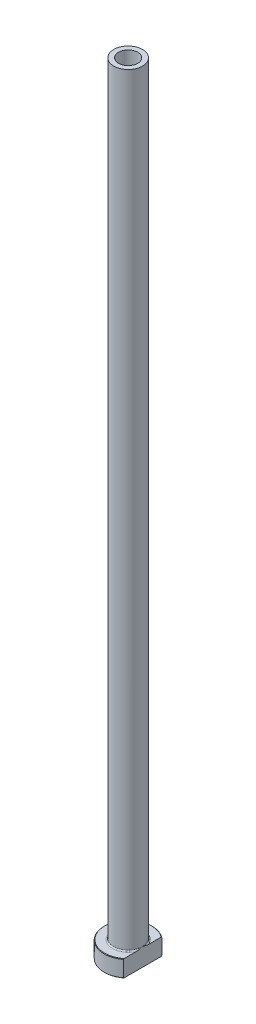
ISO-10303-21;
HEADER;
FILE_DESCRIPTION(('STEP AP214'),'2;1');
FILE_NAME('part.step','',(''),(''),'','','');
FILE_SCHEMA(('AUTOMOTIVE_DESIGN { 1 0 10303 214 1 1 1 1 }'));
ENDSEC;
DATA;
#1=APPLICATION_CONTEXT('core data for automotive mechanical design processes');
#2=APPLICATION_PROTOCOL_DEFINITION('international standard','automotive_design',2000,#1);
#3=PRODUCT_CONTEXT('',#1,'mechanical');
#4=PRODUCT('Part','Part','',(#3));
#5=PRODUCT_RELATED_PRODUCT_CATEGORY('part','',(#4));
#6=PRODUCT_DEFINITION_FORMATION('','',#4);
#7=PRODUCT_DEFINITION_CONTEXT('part definition',#1,'design');
#8=PRODUCT_DEFINITION('design','',#6,#7);
#9=PRODUCT_DEFINITION_SHAPE('','',#8);
#10=(LENGTH_UNIT() NAMED_UNIT(*) SI_UNIT(.MILLI.,.METRE.));
#11=(NAMED_UNIT(*) PLANE_ANGLE_UNIT() SI_UNIT($,.RADIAN.));
#12=(NAMED_UNIT(*) SI_UNIT($,.STERADIAN.) SOLID_ANGLE_UNIT());
#13=UNCERTAINTY_MEASURE_WITH_UNIT(LENGTH_MEASURE(1.E-05),#10,'distance_accuracy_value','');
#14=(GEOMETRIC_REPRESENTATION_CONTEXT(3) GLOBAL_UNCERTAINTY_ASSIGNED_CONTEXT((#13)) GLOBAL_UNIT_ASSIGNED_CONTEXT((#10,
#11,#12)) REPRESENTATION_CONTEXT('',''));
#15=CARTESIAN_POINT('',(0.,0.,0.));
#16=DIRECTION('',(0.,0.,1.));
#17=DIRECTION('',(1.,0.,0.));
#18=AXIS2_PLACEMENT_3D('',#15,#16,#17);
#19=CARTESIAN_POINT('',(0.,92.1876809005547,0.));
#20=DIRECTION('',(0.,1.,0.));
#21=DIRECTION('',(0.,0.,1.));
#22=AXIS2_PLACEMENT_3D('',#19,#20,#21);
#23=CYLINDRICAL_SURFACE('',#22,4.00000000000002);
#24=CARTESIAN_POINT('',(0.,325.,0.));
#25=DIRECTION('',(0.,1.,0.));
#26=DIRECTION('',(0.,0.,1.));
#27=AXIS2_PLACEMENT_3D('',#24,#25,#26);
#28=CIRCLE('',#27,4.00000000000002);
#29=CARTESIAN_POINT('',(0.,325.,4.00000000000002));
#30=VERTEX_POINT('',#29);
#31=EDGE_CURVE('E167',#30,#30,#28,.T.);
#32=ORIENTED_EDGE('',*,*,#31,.T.);
#33=EDGE_LOOP('',(#32));
#34=FACE_BOUND('',#33,.T.);
#35=CARTESIAN_POINT('',(0.,280.,0.));
#36=DIRECTION('',(0.,1.,0.));
#37=DIRECTION('',(0.,0.,1.));
#38=AXIS2_PLACEMENT_3D('',#35,#36,#37);
#39=CIRCLE('',#38,4.00000000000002);
#40=CARTESIAN_POINT('',(0.,280.,4.00000000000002));
#41=VERTEX_POINT('',#40);
#42=EDGE_CURVE('E170',#41,#41,#39,.T.);
#43=ORIENTED_EDGE('',*,*,#42,.F.);
#44=EDGE_LOOP('',(#43));
#45=FACE_BOUND('',#44,.T.);
#46=ADVANCED_FACE('F32',(#34,#45),#23,.F.);
#47=CARTESIAN_POINT('',(-4.00000000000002,325.,0.));
#48=DIRECTION('',(0.,1.,0.));
#49=DIRECTION('',(0.,0.,1.));
#50=AXIS2_PLACEMENT_3D('',#47,#48,#49);
#51=PLANE('',#50);
#52=CARTESIAN_POINT('',(0.,325.,0.));
#53=DIRECTION('',(0.,1.,0.));
#54=DIRECTION('',(0.,0.,1.));
#55=AXIS2_PLACEMENT_3D('',#52,#53,#54);
#56=CIRCLE('',#55,6.00000000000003);
#57=CARTESIAN_POINT('',(0.,325.,6.00000000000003));
#58=VERTEX_POINT('',#57);
#59=EDGE_CURVE('E174',#58,#58,#56,.T.);
#60=ORIENTED_EDGE('',*,*,#59,.T.);
#61=EDGE_LOOP('',(#60));
#62=FACE_BOUND('',#61,.T.);
#63=ORIENTED_EDGE('',*,*,#31,.F.);
#64=EDGE_LOOP('',(#63));
#65=FACE_BOUND('',#64,.T.);
#66=ADVANCED_FACE('F157',(#62,#65),#51,.T.);
#67=CARTESIAN_POINT('',(0.,92.1876809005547,0.));
#68=DIRECTION('',(0.,1.,0.));
#69=DIRECTION('',(0.,0.,1.));
#70=AXIS2_PLACEMENT_3D('',#67,#68,#69);
#71=CYLINDRICAL_SURFACE('',#70,6.00000000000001);
#72=CARTESIAN_POINT('',(0.,7.50000000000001,0.));
#73=DIRECTION('',(0.,1.,0.));
#74=DIRECTION('',(0.,0.,1.));
#75=AXIS2_PLACEMENT_3D('',#72,#73,#74);
#76=CIRCLE('',#75,6.00000000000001);
#77=CARTESIAN_POINT('',(6.,7.50000000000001,0.));
#78=VERTEX_POINT('',#77);
#79=EDGE_CURVE('E180',#78,#78,#76,.T.);
#80=ORIENTED_EDGE('',*,*,#79,.T.);
#81=EDGE_LOOP('',(#80));
#82=FACE_BOUND('',#81,.T.);
#83=ORIENTED_EDGE('',*,*,#59,.F.);
#84=EDGE_LOOP('',(#83));
#85=FACE_BOUND('',#84,.T.);
#86=ADVANCED_FACE('F162',(#82,#85),#71,.T.);
#87=CARTESIAN_POINT('',(-5.99999999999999,7.,0.));
#88=DIRECTION('',(0.,1.,0.));
#89=DIRECTION('',(0.,0.,1.));
#90=AXIS2_PLACEMENT_3D('',#87,#88,#89);
#91=PLANE('',#90);
#92=DIRECTION('',(0.,0.,1.));
#93=VECTOR('',#92,1.);
#94=CARTESIAN_POINT('',(6.,7.,0.));
#95=LINE('',#94,#93);
#96=CARTESIAN_POINT('',(6.,7.,-7.74854825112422));
#97=VERTEX_POINT('',#96);
#98=CARTESIAN_POINT('',(6.,7.,-2.50000000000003));
#99=VERTEX_POINT('',#98);
#100=EDGE_CURVE('E54',#97,#99,#95,.T.);
#101=ORIENTED_EDGE('',*,*,#100,.F.);
#102=CARTESIAN_POINT('',(0.,7.,0.));
#103=DIRECTION('',(0.,1.,0.));
#104=DIRECTION('',(0.,0.,1.));
#105=AXIS2_PLACEMENT_3D('',#102,#103,#104);
#106=CIRCLE('',#105,9.80000000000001);
#107=CARTESIAN_POINT('',(5.99999999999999,7.,7.74854825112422));
#108=VERTEX_POINT('',#107);
#109=EDGE_CURVE('E186',#97,#108,#106,.T.);
#110=ORIENTED_EDGE('',*,*,#109,.T.);
#111=CARTESIAN_POINT('',(6.,7.,2.50000000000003));
#112=VERTEX_POINT('',#111);
#113=EDGE_CURVE('E134',#112,#108,#95,.T.);
#114=ORIENTED_EDGE('',*,*,#113,.F.);
#115=CARTESIAN_POINT('',(0.,7.,0.));
#116=DIRECTION('',(0.,1.,0.));
#117=DIRECTION('',(0.,0.,1.));
#118=AXIS2_PLACEMENT_3D('',#115,#116,#117);
#119=CIRCLE('',#118,6.50000000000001);
#120=EDGE_CURVE('E183',#112,#99,#119,.F.);
#121=ORIENTED_EDGE('',*,*,#120,.T.);
#122=EDGE_LOOP('',(#101,#110,#114,#121));
#123=FACE_BOUND('',#122,.T.);
#124=ADVANCED_FACE('F197',(#123),#91,.T.);
#125=CARTESIAN_POINT('',(0.,92.1876809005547,0.));
#126=DIRECTION('',(0.,1.,0.));
#127=DIRECTION('',(0.,0.,1.));
#128=AXIS2_PLACEMENT_3D('',#125,#126,#127);
#129=CYLINDRICAL_SURFACE('',#128,9.99999999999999);
#130=DIRECTION('',(0.,-1.,0.));
#131=VECTOR('',#130,1.);
#132=CARTESIAN_POINT('',(5.99999999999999,325.,7.99999999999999));
#133=LINE('',#132,#131);
#134=CARTESIAN_POINT('',(5.99999999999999,6.80000000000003,7.99999999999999));
#135=VERTEX_POINT('',#134);
#136=CARTESIAN_POINT('',(5.99999999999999,0.200000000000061,7.99999999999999));
#137=VERTEX_POINT('',#136);
#138=EDGE_CURVE('E82',#135,#137,#133,.T.);
#139=ORIENTED_EDGE('',*,*,#138,.F.);
#140=CARTESIAN_POINT('',(0.,6.80000000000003,0.));
#141=DIRECTION('',(0.,1.,0.));
#142=DIRECTION('',(0.,0.,1.));
#143=AXIS2_PLACEMENT_3D('',#140,#141,#142);
#144=CIRCLE('',#143,9.99999999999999);
#145=CARTESIAN_POINT('',(6.,6.80000000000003,-7.99999999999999));
#146=VERTEX_POINT('',#145);
#147=EDGE_CURVE('E95',#135,#146,#144,.F.);
#148=ORIENTED_EDGE('',*,*,#147,.T.);
#149=DIRECTION('',(0.,-1.,0.));
#150=VECTOR('',#149,1.);
#151=CARTESIAN_POINT('',(6.,325.,-7.99999999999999));
#152=LINE('',#151,#150);
#153=CARTESIAN_POINT('',(6.,0.200000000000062,-7.99999999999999));
#154=VERTEX_POINT('',#153);
#155=EDGE_CURVE('E192',#146,#154,#152,.T.);
#156=ORIENTED_EDGE('',*,*,#155,.T.);
#157=CARTESIAN_POINT('',(0.,0.200000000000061,0.));
#158=DIRECTION('',(0.,-1.,0.));
#159=DIRECTION('',(0.,0.,-1.));
#160=AXIS2_PLACEMENT_3D('',#157,#158,#159);
#161=CIRCLE('',#160,9.99999999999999);
#162=EDGE_CURVE('E98',#154,#137,#161,.F.);
#163=ORIENTED_EDGE('',*,*,#162,.T.);
#164=EDGE_LOOP('',(#139,#148,#156,#163));
#165=FACE_BOUND('',#164,.T.);
#166=ADVANCED_FACE('F190',(#165),#129,.T.);
#167=CARTESIAN_POINT('',(-9.99999999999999,0.,0.));
#168=DIRECTION('',(0.,-1.,0.));
#169=DIRECTION('',(0.,0.,-1.));
#170=AXIS2_PLACEMENT_3D('',#167,#168,#169);
#171=PLANE('',#170);
#172=CARTESIAN_POINT('',(0.,0.,0.));
#173=DIRECTION('',(0.,-1.,0.));
#174=DIRECTION('',(0.,0.,-1.));
#175=AXIS2_PLACEMENT_3D('',#172,#173,#174);
#176=CIRCLE('',#175,4.75);
#177=CARTESIAN_POINT('',(0.,0.,-4.75));
#178=VERTEX_POINT('',#177);
#179=EDGE_CURVE('E40',#178,#178,#176,.F.);
#180=ORIENTED_EDGE('',*,*,#179,.T.);
#181=EDGE_LOOP('',(#180));
#182=FACE_BOUND('',#181,.T.);
#183=DIRECTION('',(0.,0.,-1.));
#184=VECTOR('',#183,1.);
#185=CARTESIAN_POINT('',(5.99999999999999,0.,7.99999999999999));
#186=LINE('',#185,#184);
#187=CARTESIAN_POINT('',(5.99999999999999,0.,7.74854825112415));
#188=VERTEX_POINT('',#187);
#189=CARTESIAN_POINT('',(6.,0.,-7.74854825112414));
#190=VERTEX_POINT('',#189);
#191=EDGE_CURVE('E47',#188,#190,#186,.T.);
#192=ORIENTED_EDGE('',*,*,#191,.F.);
#193=CARTESIAN_POINT('',(0.,0.,0.));
#194=DIRECTION('',(0.,-1.,0.));
#195=DIRECTION('',(0.,0.,-1.));
#196=AXIS2_PLACEMENT_3D('',#193,#194,#195);
#197=CIRCLE('',#196,9.79999999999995);
#198=EDGE_CURVE('E92',#188,#190,#197,.T.);
#199=ORIENTED_EDGE('',*,*,#198,.T.);
#200=EDGE_LOOP('',(#192,#199));
#201=FACE_BOUND('',#200,.T.);
#202=ADVANCED_FACE('F91',(#182,#201),#171,.T.);
#203=CARTESIAN_POINT('',(0.,92.1876809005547,0.));
#204=DIRECTION('',(0.,1.,0.));
#205=DIRECTION('',(0.,0.,1.));
#206=AXIS2_PLACEMENT_3D('',#203,#204,#205);
#207=CYLINDRICAL_SURFACE('',#206,4.25000000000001);
#208=CARTESIAN_POINT('',(0.,0.499999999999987,0.));
#209=DIRECTION('',(0.,-1.,0.));
#210=DIRECTION('',(0.,0.,-1.));
#211=AXIS2_PLACEMENT_3D('',#208,#209,#210);
#212=CIRCLE('',#211,4.25000000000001);
#213=CARTESIAN_POINT('',(0.,0.499999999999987,-4.25000000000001));
#214=VERTEX_POINT('',#213);
#215=EDGE_CURVE('E11',#214,#214,#212,.T.);
#216=ORIENTED_EDGE('',*,*,#215,.T.);
#217=EDGE_LOOP('',(#216));
#218=FACE_BOUND('',#217,.T.);
#219=CARTESIAN_POINT('',(0.,268.,0.));
#220=DIRECTION('',(0.,1.,0.));
#221=DIRECTION('',(0.,0.,1.));
#222=AXIS2_PLACEMENT_3D('',#219,#220,#221);
#223=CIRCLE('',#222,4.25000000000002);
#224=CARTESIAN_POINT('',(0.,268.,4.25000000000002));
#225=VERTEX_POINT('',#224);
#226=EDGE_CURVE('E172',#225,#225,#223,.T.);
#227=ORIENTED_EDGE('',*,*,#226,.T.);
#228=EDGE_LOOP('',(#227));
#229=FACE_BOUND('',#228,.T.);
#230=ADVANCED_FACE('F215',(#218,#229),#207,.F.);
#231=CARTESIAN_POINT('',(0.,268.,0.));
#232=DIRECTION('',(0.,-1.,0.));
#233=DIRECTION('',(0.,0.,-1.));
#234=AXIS2_PLACEMENT_3D('',#231,#232,#233);
#235=CONICAL_SURFACE('',#234,4.25000000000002,0.0208303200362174);
#236=ORIENTED_EDGE('',*,*,#42,.T.);
#237=EDGE_LOOP('',(#236));
#238=FACE_BOUND('',#237,.T.);
#239=ORIENTED_EDGE('',*,*,#226,.F.);
#240=EDGE_LOOP('',(#239));
#241=FACE_BOUND('',#240,.T.);
#242=ADVANCED_FACE('F111',(#238,#241),#235,.F.);
#243=CARTESIAN_POINT('',(0.,7.50000000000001,0.));
#244=DIRECTION('',(0.,1.,0.));
#245=DIRECTION('',(0.,0.,1.));
#246=AXIS2_PLACEMENT_3D('',#243,#244,#245);
#247=TOROIDAL_SURFACE('',#246,6.50000000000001,0.5);
#248=ORIENTED_EDGE('',*,*,#120,.F.);
#249=CARTESIAN_POINT('',(6.,7.50000000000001,0.));
#250=CARTESIAN_POINT('',(6.,7.50000080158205,6.70578721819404E-11));
#251=CARTESIAN_POINT('',(6.,7.50000160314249,2.62462886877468E-07));
#252=CARTESIAN_POINT('',(6.,7.50000311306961,1.01907237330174E-06));
#253=CARTESIAN_POINT('',(6.,7.500003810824,1.52837988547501E-06));
#254=CARTESIAN_POINT('',(6.,7.50000523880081,2.74467699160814E-06));
#255=CARTESIAN_POINT('',(6.,7.50000595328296,3.47066827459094E-06));
#256=CARTESIAN_POINT('',(6.,7.50000725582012,4.99336301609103E-06));
#257=CARTESIAN_POINT('',(6.,7.50000784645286,5.78800239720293E-06));
#258=CARTESIAN_POINT('',(6.,7.50000997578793,8.796617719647E-06));
#259=CARTESIAN_POINT('',(6.,7.50001139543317,1.10980696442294E-05));
#260=CARTESIAN_POINT('',(6.,7.50001378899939,1.57116121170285E-05));
#261=CARTESIAN_POINT('',(6.,7.5000147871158,1.80117467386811E-05));
#262=CARTESIAN_POINT('',(6.,7.50001885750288,2.75423879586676E-05));
#263=CARTESIAN_POINT('',(6.,7.50002181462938,3.48285137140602E-05));
#264=CARTESIAN_POINT('',(6.,7.50002628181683,4.87408463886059E-05));
#265=CARTESIAN_POINT('',(6.,7.50002793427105,5.5321444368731E-05));
#266=CARTESIAN_POINT('',(6.,7.50003978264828,0.000103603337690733));
#267=CARTESIAN_POINT('',(6.,7.50004857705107,0.000145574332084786));
#268=CARTESIAN_POINT('',(6.,7.50008704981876,0.000310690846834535));
#269=CARTESIAN_POINT('',(6.,7.5001239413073,0.000432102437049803));
#270=CARTESIAN_POINT('',(6.,7.50026686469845,0.000911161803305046));
#271=CARTESIAN_POINT('',(6.,7.50036807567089,0.00126981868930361));
#272=CARTESIAN_POINT('',(6.,7.50077195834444,0.00268961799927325));
#273=CARTESIAN_POINT('',(6.,7.50108058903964,0.00374948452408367));
#274=CARTESIAN_POINT('',(6.,7.50236320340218,0.0081665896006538));
#275=CARTESIAN_POINT('',(6.,7.50332976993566,0.0115254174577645));
#276=CARTESIAN_POINT('',(5.99999999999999,7.51709820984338,0.0593544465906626));
#277=CARTESIAN_POINT('',(6.,7.52995465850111,0.103813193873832));
#278=CARTESIAN_POINT('',(6.,7.55506029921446,0.19097766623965));
#279=CARTESIAN_POINT('',(6.,7.56731321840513,0.233682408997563));
#280=CARTESIAN_POINT('',(6.,7.59325665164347,0.324512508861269));
#281=CARTESIAN_POINT('',(6.,7.60693346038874,0.372641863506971));
#282=CARTESIAN_POINT('',(6.,7.63422038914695,0.469489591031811));
#283=CARTESIAN_POINT('',(6.,7.64782813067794,0.518208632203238));
#284=CARTESIAN_POINT('',(6.,7.68043734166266,0.636338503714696));
#285=CARTESIAN_POINT('',(6.,7.69928754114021,0.705791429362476));
#286=CARTESIAN_POINT('',(6.,7.73566887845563,0.843102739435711));
#287=CARTESIAN_POINT('',(6.,7.75322160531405,0.910955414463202));
#288=CARTESIAN_POINT('',(6.,7.80024878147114,1.09857433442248));
#289=CARTESIAN_POINT('',(6.,7.82864900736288,1.21861610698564));
#290=CARTESIAN_POINT('',(6.,7.88105633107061,1.46081534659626));
#291=CARTESIAN_POINT('',(6.,7.90502088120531,1.58298212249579));
#292=CARTESIAN_POINT('',(6.,7.94810499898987,1.83866408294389));
#293=CARTESIAN_POINT('',(6.,7.96665856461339,1.97228081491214));
#294=CARTESIAN_POINT('',(6.,7.98621697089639,2.17329578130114));
#295=CARTESIAN_POINT('',(6.,7.99135613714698,2.24029152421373));
#296=CARTESIAN_POINT('',(6.,7.99832928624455,2.37444824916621));
#297=CARTESIAN_POINT('',(6.,8.00016429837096,2.44160917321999));
#298=CARTESIAN_POINT('',(6.,7.99984674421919,2.56298631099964));
#299=CARTESIAN_POINT('',(6.,7.99839439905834,2.61720324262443));
#300=CARTESIAN_POINT('',(6.,7.9923655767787,2.72552036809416));
#301=CARTESIAN_POINT('',(6.,7.98778645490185,2.77962042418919));
#302=CARTESIAN_POINT('',(6.,7.97492915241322,2.88664710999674));
#303=CARTESIAN_POINT('',(6.,7.96670262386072,2.93957965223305));
#304=CARTESIAN_POINT('',(6.,7.94570253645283,3.04448333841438));
#305=CARTESIAN_POINT('',(6.,7.93293488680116,3.09645563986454));
#306=CARTESIAN_POINT('',(6.,7.90135968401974,3.19943606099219));
#307=CARTESIAN_POINT('',(6.,7.8824717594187,3.25042120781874));
#308=CARTESIAN_POINT('',(6.,7.8481868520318,3.3240378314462));
#309=CARTESIAN_POINT('',(6.,7.83579052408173,3.34806431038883));
#310=CARTESIAN_POINT('',(6.,7.80866016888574,3.39474488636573));
#311=CARTESIAN_POINT('',(6.,7.79392968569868,3.41740099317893));
#312=CARTESIAN_POINT('',(6.,7.76577135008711,3.45524173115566));
#313=CARTESIAN_POINT('',(6.,7.75294719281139,3.47087266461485));
#314=CARTESIAN_POINT('',(6.,7.72556313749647,3.50058040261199));
#315=CARTESIAN_POINT('',(6.,7.7110020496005,3.51465612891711));
#316=CARTESIAN_POINT('',(6.,7.67984897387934,3.54077006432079));
#317=CARTESIAN_POINT('',(6.,7.66323651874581,3.55278430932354));
#318=CARTESIAN_POINT('',(6.,7.62815222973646,3.57370259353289));
#319=CARTESIAN_POINT('',(6.,7.60968501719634,3.58261412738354));
#320=CARTESIAN_POINT('',(6.,7.57639898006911,3.59454653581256));
#321=CARTESIAN_POINT('',(6.,7.56191673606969,3.5985038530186));
#322=CARTESIAN_POINT('',(6.,7.53249228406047,3.60392336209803));
#323=CARTESIAN_POINT('',(6.,7.51755044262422,3.60538749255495));
#324=CARTESIAN_POINT('',(6.,7.48761833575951,3.60568912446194));
#325=CARTESIAN_POINT('',(6.,7.47262803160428,3.60452285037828));
#326=CARTESIAN_POINT('',(6.,7.44306278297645,3.59966500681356));
#327=CARTESIAN_POINT('',(6.,7.42848812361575,3.59597174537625));
#328=CARTESIAN_POINT('',(6.,7.3970215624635,3.58531109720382));
#329=CARTESIAN_POINT('',(6.,7.38031267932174,3.57780732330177));
#330=CARTESIAN_POINT('',(6.,7.34834450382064,3.56018434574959));
#331=CARTESIAN_POINT('',(6.,7.33308764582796,3.55006085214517));
#332=CARTESIAN_POINT('',(6.,7.29715308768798,3.52252389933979));
#333=CARTESIAN_POINT('',(6.,7.27737832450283,3.50394102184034));
#334=CARTESIAN_POINT('',(6.,7.2408841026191,3.46399503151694));
#335=CARTESIAN_POINT('',(6.,7.22417302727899,3.44262455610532));
#336=CARTESIAN_POINT('',(6.,7.18148338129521,3.38088102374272));
#337=CARTESIAN_POINT('',(6.,7.15831783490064,3.33858120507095));
#338=CARTESIAN_POINT('',(6.,7.11822747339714,3.25128083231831));
#339=CARTESIAN_POINT('',(6.,7.10130560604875,3.20627901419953));
#340=CARTESIAN_POINT('',(6.,7.07193388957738,3.11375892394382));
#341=CARTESIAN_POINT('',(6.,7.0595925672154,3.06620687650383));
#342=CARTESIAN_POINT('',(6.,7.03888782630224,2.97022063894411));
#343=CARTESIAN_POINT('',(6.,7.03052890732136,2.92178551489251));
#344=CARTESIAN_POINT('',(6.,7.0169756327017,2.82374574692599));
#345=CARTESIAN_POINT('',(6.,7.01183067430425,2.7741344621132));
#346=CARTESIAN_POINT('',(6.,7.00435015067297,2.6747526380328));
#347=CARTESIAN_POINT('',(6.,7.00201229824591,2.62498226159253));
#348=CARTESIAN_POINT('',(6.,6.9989719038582,2.49377014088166));
#349=CARTESIAN_POINT('',(6.,7.00025005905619,2.41228296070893));
#350=CARTESIAN_POINT('',(6.,7.00775652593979,2.24952135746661));
#351=CARTESIAN_POINT('',(6.,7.01398784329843,2.16824709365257));
#352=CARTESIAN_POINT('',(6.,7.03045087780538,2.0057553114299));
#353=CARTESIAN_POINT('',(6.,7.04070001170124,1.92453960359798));
#354=CARTESIAN_POINT('',(6.,7.06442774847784,1.76257601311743));
#355=CARTESIAN_POINT('',(6.,7.07790697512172,1.68182822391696));
#356=CARTESIAN_POINT('',(6.,7.11973611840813,1.45394312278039));
#357=CARTESIAN_POINT('',(6.,7.1511384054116,1.30736987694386));
#358=CARTESIAN_POINT('',(6.,7.21927147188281,1.01717316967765));
#359=CARTESIAN_POINT('',(6.,7.25594155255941,0.873534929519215));
#360=CARTESIAN_POINT('',(6.,7.30765759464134,0.680321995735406));
#361=CARTESIAN_POINT('',(6.,7.32124979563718,0.630351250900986));
#362=CARTESIAN_POINT('',(6.,7.34913735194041,0.529103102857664));
#363=CARTESIAN_POINT('',(6.,7.36344174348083,0.477828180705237));
#364=CARTESIAN_POINT('',(6.,7.3880931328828,0.390268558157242));
#365=CARTESIAN_POINT('',(6.,7.39837954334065,0.353966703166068));
#366=CARTESIAN_POINT('',(6.,7.41893445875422,0.28177830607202));
#367=CARTESIAN_POINT('',(6.,7.42920197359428,0.245891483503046));
#368=CARTESIAN_POINT('',(6.,7.44864004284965,0.178137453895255));
#369=CARTESIAN_POINT('',(6.,7.45780513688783,0.146268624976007));
#370=CARTESIAN_POINT('',(6.,7.47656016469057,0.0812304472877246));
#371=CARTESIAN_POINT('',(5.99999999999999,7.48615204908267,0.0480615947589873));
#372=CARTESIAN_POINT('',(6.,7.4966696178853,0.0115277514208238));
#373=CARTESIAN_POINT('',(6.,7.49763547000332,0.00817123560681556));
#374=CARTESIAN_POINT('',(6.,7.49891791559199,0.00375466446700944));
#375=CARTESIAN_POINT('',(6.,7.49922706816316,0.00269301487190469));
#376=CARTESIAN_POINT('',(6.,7.49963158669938,0.00127098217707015));
#377=CARTESIAN_POINT('',(6.,7.49973292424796,0.000911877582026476));
#378=CARTESIAN_POINT('',(6.,7.49987600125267,0.000432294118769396));
#379=CARTESIAN_POINT('',(6.,7.49991291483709,0.000310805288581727));
#380=CARTESIAN_POINT('',(6.,7.49995140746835,0.000145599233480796));
#381=CARTESIAN_POINT('',(6.,7.49996020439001,0.000103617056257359));
#382=CARTESIAN_POINT('',(6.,7.49997205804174,5.53238264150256E-05));
#383=CARTESIAN_POINT('',(6.,7.49997371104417,4.87425744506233E-05));
#384=CARTESIAN_POINT('',(6.,7.49997817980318,3.48289298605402E-05));
#385=CARTESIAN_POINT('',(6.,7.49998113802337,2.75421804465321E-05));
#386=CARTESIAN_POINT('',(6.,7.49998520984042,1.80109026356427E-05));
#387=CARTESIAN_POINT('',(6.,7.49998620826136,1.57107189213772E-05));
#388=CARTESIAN_POINT('',(6.,7.49998860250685,1.10971311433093E-05));
#389=CARTESIAN_POINT('',(6.,7.49999002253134,8.79568853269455E-06));
#390=CARTESIAN_POINT('',(6.,7.49999215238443,5.78714815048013E-06));
#391=CARTESIAN_POINT('',(6.,7.49999274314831,4.99254470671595E-06));
#392=CARTESIAN_POINT('',(6.,7.49999404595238,3.46994550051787E-06));
#393=CARTESIAN_POINT('',(6.,7.49999476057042,2.74401447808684E-06));
#394=CARTESIAN_POINT('',(6.,7.4999961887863,1.5278603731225E-06));
#395=CARTESIAN_POINT('',(6.,7.4999968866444,1.01863078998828E-06));
#396=CARTESIAN_POINT('',(6.,7.49999839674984,2.62215751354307E-07));
#397=CARTESIAN_POINT('',(6.,7.49999919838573,-6.70592677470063E-11));
#398=CARTESIAN_POINT('',(6.,7.50000000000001,0.));
#399=B_SPLINE_CURVE_WITH_KNOTS('',3,(#249,#250,#251,#252,#253,#254,#255,#256,#257,#258,#259,
#260,#261,#262,#263,#264,#265,#266,#267,#268,#269,#270,#271,#272,#273,#274,#275,#276,#277,#278,
#279,#280,#281,#282,#283,#284,#285,#286,#287,#288,#289,#290,#291,#292,#293,#294,#295,#296,#297,
#298,#299,#300,#301,#302,#303,#304,#305,#306,#307,#308,#309,#310,#311,#312,#313,#314,#315,#316,
#317,#318,#319,#320,#321,#322,#323,#324,#325,#326,#327,#328,#329,#330,#331,#332,#333,#334,#335,
#336,#337,#338,#339,#340,#341,#342,#343,#344,#345,#346,#347,#348,#349,#350,#351,#352,#353,#354,
#355,#356,#357,#358,#359,#360,#361,#362,#363,#364,#365,#366,#367,#368,#369,#370,#371,#372,#373,
#374,#375,#376,#377,#378,#379,#380,#381,#382,#383,#384,#385,#386,#387,#388,#389,#390,#391,#392,
#393,#394,#395,#396,#397,#398),.UNSPECIFIED.,.T.,.F.,(4,2,2,2,2,2,2,2,2,2,2,2,2,2,2,2,2,2,2,2,2,
2,2,2,2,2,2,2,2,2,2,2,2,2,2,2,2,2,2,2,2,2,2,2,2,2,2,2,2,2,2,2,2,2,2,2,2,2,2,2,2,2,2,2,2,2,2,2,2,
2,2,2,2,2,4),(0.,2.41532701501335E-06,5.00161511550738E-06,8.04115600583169E-06,
1.10092267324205E-05,1.90889688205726E-05,2.66047306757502E-05,5.01454015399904E-05,
7.04739942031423E-05,0.000199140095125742,0.000579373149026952,0.0016978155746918,
0.00500893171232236,0.0154949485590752,0.154330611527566,0.287615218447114,0.43771908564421,
0.589470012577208,0.805361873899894,1.0156173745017,1.38561400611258,1.75899405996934,
2.16331287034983,2.36482907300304,2.56628249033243,2.72891861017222,2.89169246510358,
3.05223140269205,3.21256219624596,3.37509011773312,3.4560997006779,3.53698744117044,
3.59753760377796,3.65812948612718,3.71938396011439,3.78048942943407,3.82533702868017,
3.87014974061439,3.91502681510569,3.95993396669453,4.01458097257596,4.06931803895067,
4.1502680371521,4.23143634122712,4.37530581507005,4.51924312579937,4.66640085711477,
4.81372446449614,4.96325999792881,5.11267360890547,5.35695170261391,5.60137814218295,
5.84687607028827,6.09242144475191,6.54191534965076,6.98659302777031,7.14195169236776,
7.30164895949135,7.41484221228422,7.52682205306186,7.62630458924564,7.72988447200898,
7.74036324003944,7.74367992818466,7.74479976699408,7.74518024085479,7.74530894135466,
7.74532927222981,7.74535281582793,7.74536033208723,7.74536841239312,7.74537138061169,
7.74537442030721,7.74537700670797,7.74537942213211),.UNSPECIFIED.);
#400=EDGE_CURVE('E126',#112,#78,#399,.T.);
#401=ORIENTED_EDGE('',*,*,#400,.T.);
#402=ORIENTED_EDGE('',*,*,#79,.F.);
#403=CARTESIAN_POINT('',(6.,7.50000000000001,0.));
#404=CARTESIAN_POINT('',(6.,7.49999919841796,-6.70567544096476E-11));
#405=CARTESIAN_POINT('',(6.,7.49999839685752,-2.62462885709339E-07));
#406=CARTESIAN_POINT('',(6.,7.49999688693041,-1.01907237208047E-06));
#407=CARTESIAN_POINT('',(6.,7.49999618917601,-1.52837988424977E-06));
#408=CARTESIAN_POINT('',(6.,7.4999947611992,-2.74467699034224E-06));
#409=CARTESIAN_POINT('',(6.,7.49999404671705,-3.47066827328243E-06));
#410=CARTESIAN_POINT('',(6.,7.49999274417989,-4.99336301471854E-06));
#411=CARTESIAN_POINT('',(6.,7.49999215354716,-5.78800239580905E-06));
#412=CARTESIAN_POINT('',(6.,7.49999002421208,-8.79661771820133E-06));
#413=CARTESIAN_POINT('',(6.,7.49998860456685,-1.10980696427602E-05));
#414=CARTESIAN_POINT('',(6.,7.49998621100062,-1.5711612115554E-05));
#415=CARTESIAN_POINT('',(6.,7.49998521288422,-1.80117467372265E-05));
#416=CARTESIAN_POINT('',(6.,7.49998114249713,-2.75423879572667E-05));
#417=CARTESIAN_POINT('',(6.,7.49997818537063,-3.48285137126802E-05));
#418=CARTESIAN_POINT('',(6.,7.49997371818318,-4.8740846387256E-05));
#419=CARTESIAN_POINT('',(6.,7.49997206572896,-5.53214443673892E-05));
#420=CARTESIAN_POINT('',(6.,7.49996021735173,-0.000103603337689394));
#421=CARTESIAN_POINT('',(6.,7.49995142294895,-0.000145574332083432));
#422=CARTESIAN_POINT('',(6.,7.49991295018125,-0.000310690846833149));
#423=CARTESIAN_POINT('',(6.,7.49987605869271,-0.000432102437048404));
#424=CARTESIAN_POINT('',(6.,7.49973313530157,-0.000911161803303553));
#425=CARTESIAN_POINT('',(6.,7.49963192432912,-0.00126981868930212));
#426=CARTESIAN_POINT('',(6.,7.49922804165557,-0.00268961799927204));
#427=CARTESIAN_POINT('',(6.,7.49891941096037,-0.00374948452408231));
#428=CARTESIAN_POINT('',(6.,7.49763679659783,-0.00816658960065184));
#429=CARTESIAN_POINT('',(6.,7.49667023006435,-0.0115254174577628));
#430=CARTESIAN_POINT('',(5.99999999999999,7.48290179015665,-0.0593544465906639));
#431=CARTESIAN_POINT('',(6.,7.47004534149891,-0.10381319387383));
#432=CARTESIAN_POINT('',(6.,7.44493970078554,-0.190977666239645));
#433=CARTESIAN_POINT('',(6.,7.43268678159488,-0.233682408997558));
#434=CARTESIAN_POINT('',(6.,7.40674334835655,-0.324512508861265));
#435=CARTESIAN_POINT('',(6.,7.39306653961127,-0.372641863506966));
#436=CARTESIAN_POINT('',(6.,7.36577961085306,-0.469489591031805));
#437=CARTESIAN_POINT('',(6.,7.35217186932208,-0.518208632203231));
#438=CARTESIAN_POINT('',(6.,7.31956265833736,-0.636338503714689));
#439=CARTESIAN_POINT('',(6.,7.30071245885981,-0.70579142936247));
#440=CARTESIAN_POINT('',(6.,7.26433112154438,-0.843102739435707));
#441=CARTESIAN_POINT('',(6.,7.24677839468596,-0.910955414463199));
#442=CARTESIAN_POINT('',(6.,7.19975121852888,-1.09857433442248));
#443=CARTESIAN_POINT('',(6.,7.17135099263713,-1.21861610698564));
#444=CARTESIAN_POINT('',(6.,7.1189436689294,-1.46081534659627));
#445=CARTESIAN_POINT('',(6.,7.0949791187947,-1.58298212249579));
#446=CARTESIAN_POINT('',(6.,7.05189500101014,-1.8386640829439));
#447=CARTESIAN_POINT('',(6.,7.03334143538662,-1.97228081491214));
#448=CARTESIAN_POINT('',(6.,7.01378302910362,-2.17329578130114));
#449=CARTESIAN_POINT('',(6.,7.00864386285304,-2.24029152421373));
#450=CARTESIAN_POINT('',(6.,7.00167071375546,-2.37444824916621));
#451=CARTESIAN_POINT('',(6.,6.99983570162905,-2.44160917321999));
#452=CARTESIAN_POINT('',(6.,7.00015325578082,-2.56298631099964));
#453=CARTESIAN_POINT('',(6.,7.00160560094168,-2.61720324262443));
#454=CARTESIAN_POINT('',(6.,7.00763442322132,-2.72552036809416));
#455=CARTESIAN_POINT('',(6.,7.01221354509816,-2.77962042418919));
#456=CARTESIAN_POINT('',(6.,7.02507084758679,-2.88664710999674));
#457=CARTESIAN_POINT('',(6.,7.03329737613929,-2.93957965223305));
#458=CARTESIAN_POINT('',(6.,7.05429746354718,-3.04448333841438));
#459=CARTESIAN_POINT('',(6.,7.06706511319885,-3.09645563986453));
#460=CARTESIAN_POINT('',(6.,7.09864031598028,-3.19943606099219));
#461=CARTESIAN_POINT('',(6.,7.11752824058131,-3.25042120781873));
#462=CARTESIAN_POINT('',(6.,7.15181314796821,-3.32403783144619));
#463=CARTESIAN_POINT('',(6.,7.16420947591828,-3.34806431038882));
#464=CARTESIAN_POINT('',(6.,7.19133983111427,-3.39474488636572));
#465=CARTESIAN_POINT('',(6.,7.20607031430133,-3.41740099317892));
#466=CARTESIAN_POINT('',(6.,7.23422864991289,-3.45524173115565));
#467=CARTESIAN_POINT('',(6.,7.24705280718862,-3.47087266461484));
#468=CARTESIAN_POINT('',(6.,7.27443686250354,-3.50058040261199));
#469=CARTESIAN_POINT('',(6.,7.28899795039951,-3.5146561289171));
#470=CARTESIAN_POINT('',(6.,7.32015102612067,-3.54077006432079));
#471=CARTESIAN_POINT('',(6.,7.3367634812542,-3.55278430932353));
#472=CARTESIAN_POINT('',(6.,7.37184777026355,-3.57370259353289));
#473=CARTESIAN_POINT('',(6.,7.39031498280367,-3.58261412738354));
#474=CARTESIAN_POINT('',(6.,7.4236010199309,-3.59454653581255));
#475=CARTESIAN_POINT('',(6.,7.43808326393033,-3.5985038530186));
#476=CARTESIAN_POINT('',(6.,7.46750771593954,-3.60392336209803));
#477=CARTESIAN_POINT('',(6.,7.48244955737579,-3.60538749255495));
#478=CARTESIAN_POINT('',(6.,7.51238166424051,-3.60568912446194));
#479=CARTESIAN_POINT('',(6.,7.52737196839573,-3.60452285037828));
#480=CARTESIAN_POINT('',(6.,7.55693721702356,-3.59966500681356));
#481=CARTESIAN_POINT('',(6.,7.57151187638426,-3.59597174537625));
#482=CARTESIAN_POINT('',(6.,7.60297843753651,-3.58531109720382));
#483=CARTESIAN_POINT('',(6.,7.61968732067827,-3.57780732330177));
#484=CARTESIAN_POINT('',(6.,7.65165549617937,-3.56018434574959));
#485=CARTESIAN_POINT('',(6.,7.66691235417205,-3.55006085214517));
#486=CARTESIAN_POINT('',(6.,7.70284691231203,-3.52252389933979));
#487=CARTESIAN_POINT('',(6.,7.72262167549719,-3.50394102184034));
#488=CARTESIAN_POINT('',(6.,7.75911589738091,-3.46399503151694));
#489=CARTESIAN_POINT('',(6.,7.77582697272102,-3.44262455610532));
#490=CARTESIAN_POINT('',(6.,7.8185166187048,-3.38088102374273));
#491=CARTESIAN_POINT('',(6.,7.84168216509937,-3.33858120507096));
#492=CARTESIAN_POINT('',(6.,7.88177252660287,-3.25128083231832));
#493=CARTESIAN_POINT('',(6.,7.89869439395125,-3.20627901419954));
#494=CARTESIAN_POINT('',(6.,7.92806611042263,-3.11375892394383));
#495=CARTESIAN_POINT('',(6.,7.94040743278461,-3.06620687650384));
#496=CARTESIAN_POINT('',(6.,7.96111217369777,-2.97022063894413));
#497=CARTESIAN_POINT('',(6.,7.96947109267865,-2.92178551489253));
#498=CARTESIAN_POINT('',(6.,7.98302436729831,-2.82374574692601));
#499=CARTESIAN_POINT('',(6.,7.98816932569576,-2.77413446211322));
#500=CARTESIAN_POINT('',(6.,7.99564984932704,-2.67475263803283));
#501=CARTESIAN_POINT('',(6.,7.9979877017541,-2.62498226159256));
#502=CARTESIAN_POINT('',(6.,8.00102809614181,-2.4937701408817));
#503=CARTESIAN_POINT('',(6.,7.99974994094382,-2.41228296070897));
#504=CARTESIAN_POINT('',(6.,7.99224347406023,-2.24952135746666));
#505=CARTESIAN_POINT('',(6.,7.98601215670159,-2.16824709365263));
#506=CARTESIAN_POINT('',(6.,7.96954912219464,-2.00575531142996));
#507=CARTESIAN_POINT('',(6.,7.95929998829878,-1.92453960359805));
#508=CARTESIAN_POINT('',(6.,7.93557225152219,-1.7625760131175));
#509=CARTESIAN_POINT('',(6.,7.9220930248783,-1.68182822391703));
#510=CARTESIAN_POINT('',(6.,7.8802638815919,-1.45394312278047));
#511=CARTESIAN_POINT('',(6.,7.84886159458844,-1.30736987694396));
#512=CARTESIAN_POINT('',(6.,7.78072852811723,-1.01717316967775));
#513=CARTESIAN_POINT('',(6.,7.74405844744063,-0.873534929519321));
#514=CARTESIAN_POINT('',(6.,7.6923424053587,-0.680321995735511));
#515=CARTESIAN_POINT('',(6.,7.67875020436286,-0.630351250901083));
#516=CARTESIAN_POINT('',(6.,7.65086264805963,-0.529103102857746));
#517=CARTESIAN_POINT('',(6.,7.63655825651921,-0.47782818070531));
#518=CARTESIAN_POINT('',(6.,7.61190686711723,-0.390268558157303));
#519=CARTESIAN_POINT('',(6.,7.60162045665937,-0.353966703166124));
#520=CARTESIAN_POINT('',(6.,7.5810655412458,-0.281778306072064));
#521=CARTESIAN_POINT('',(6.,7.57079802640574,-0.245891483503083));
#522=CARTESIAN_POINT('',(6.,7.55135995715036,-0.178137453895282));
#523=CARTESIAN_POINT('',(6.,7.54219486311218,-0.14626862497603));
#524=CARTESIAN_POINT('',(6.,7.52343983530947,-0.0812304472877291));
#525=CARTESIAN_POINT('',(5.99999999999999,7.5138479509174,-0.0480615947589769));
#526=CARTESIAN_POINT('',(6.,7.50333038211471,-0.0115277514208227));
#527=CARTESIAN_POINT('',(6.,7.50236452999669,-0.00817123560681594));
#528=CARTESIAN_POINT('',(6.,7.50108208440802,-0.00375466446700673));
#529=CARTESIAN_POINT('',(6.,7.50077293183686,-0.00269301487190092));
#530=CARTESIAN_POINT('',(6.,7.50036841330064,-0.0012709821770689));
#531=CARTESIAN_POINT('',(6.,7.50026707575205,-0.000911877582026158));
#532=CARTESIAN_POINT('',(6.,7.50012399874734,-0.000432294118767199));
#533=CARTESIAN_POINT('',(6.,7.50008708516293,-0.00031080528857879));
#534=CARTESIAN_POINT('',(6.,7.50004859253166,-0.000145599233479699));
#535=CARTESIAN_POINT('',(6.,7.50003979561,-0.000103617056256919));
#536=CARTESIAN_POINT('',(6.,7.50002794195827,-5.53238264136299E-05));
#537=CARTESIAN_POINT('',(6.,7.50002628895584,-4.8742574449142E-05));
#538=CARTESIAN_POINT('',(6.,7.50002182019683,-3.48289298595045E-05));
#539=CARTESIAN_POINT('',(6.,7.50001886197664,-2.75421804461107E-05));
#540=CARTESIAN_POINT('',(6.,7.50001479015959,-1.80109026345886E-05));
#541=CARTESIAN_POINT('',(6.,7.50001379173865,-1.57107189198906E-05));
#542=CARTESIAN_POINT('',(6.,7.50001139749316,-1.10971311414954E-05));
#543=CARTESIAN_POINT('',(6.,7.50000997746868,-8.79568853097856E-06));
#544=CARTESIAN_POINT('',(6.,7.50000784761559,-5.7871481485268E-06));
#545=CARTESIAN_POINT('',(6.,7.50000725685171,-4.99254470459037E-06));
#546=CARTESIAN_POINT('',(6.,7.50000595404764,-3.46994549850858E-06));
#547=CARTESIAN_POINT('',(6.,7.5000052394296,-2.74401447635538E-06));
#548=CARTESIAN_POINT('',(6.,7.50000381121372,-1.52786037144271E-06));
#549=CARTESIAN_POINT('',(6.,7.50000311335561,-1.0186307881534E-06));
#550=CARTESIAN_POINT('',(6.,7.50000160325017,-2.62215749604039E-07));
#551=CARTESIAN_POINT('',(6.,7.50000080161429,6.70607520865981E-11));
#552=CARTESIAN_POINT('',(6.,7.50000000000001,0.));
#553=B_SPLINE_CURVE_WITH_KNOTS('',3,(#403,#404,#405,#406,#407,#408,#409,#410,#411,#412,#413,
#414,#415,#416,#417,#418,#419,#420,#421,#422,#423,#424,#425,#426,#427,#428,#429,#430,#431,#432,
#433,#434,#435,#436,#437,#438,#439,#440,#441,#442,#443,#444,#445,#446,#447,#448,#449,#450,#451,
#452,#453,#454,#455,#456,#457,#458,#459,#460,#461,#462,#463,#464,#465,#466,#467,#468,#469,#470,
#471,#472,#473,#474,#475,#476,#477,#478,#479,#480,#481,#482,#483,#484,#485,#486,#487,#488,#489,
#490,#491,#492,#493,#494,#495,#496,#497,#498,#499,#500,#501,#502,#503,#504,#505,#506,#507,#508,
#509,#510,#511,#512,#513,#514,#515,#516,#517,#518,#519,#520,#521,#522,#523,#524,#525,#526,#527,
#528,#529,#530,#531,#532,#533,#534,#535,#536,#537,#538,#539,#540,#541,#542,#543,#544,#545,#546,
#547,#548,#549,#550,#551,#552),.UNSPECIFIED.,.T.,.F.,(4,2,2,2,2,2,2,2,2,2,2,2,2,2,2,2,2,2,2,2,2,
2,2,2,2,2,2,2,2,2,2,2,2,2,2,2,2,2,2,2,2,2,2,2,2,2,2,2,2,2,2,2,2,2,2,2,2,2,2,2,2,2,2,2,2,2,2,2,2,
2,2,2,2,2,4),(0.,2.41532701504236E-06,5.00161511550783E-06,8.04115600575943E-06,
1.10092267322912E-05,1.90889688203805E-05,2.66047306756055E-05,5.01454015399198E-05,
7.04739942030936E-05,0.000199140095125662,0.000579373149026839,0.00169781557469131,
0.00500893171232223,0.0154949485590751,0.154330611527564,0.287615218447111,0.437719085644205,
0.5894700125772,0.805361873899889,1.0156173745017,1.38561400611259,1.75899405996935,
2.16331287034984,2.36482907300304,2.56628249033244,2.72891861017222,2.89169246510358,
3.05223140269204,3.21256219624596,3.37509011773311,3.45609970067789,3.53698744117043,
3.59753760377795,3.65812948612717,3.71938396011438,3.78048942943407,3.82533702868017,
3.87014974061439,3.91502681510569,3.95993396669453,4.01458097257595,4.06931803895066,
4.1502680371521,4.23143634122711,4.37530581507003,4.51924312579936,4.66640085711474,
4.81372446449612,4.96325999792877,5.11267360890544,5.35695170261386,5.60137814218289,
5.8468760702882,6.09242144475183,6.54191534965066,6.98659302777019,7.14195169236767,
7.30164895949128,7.41484221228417,7.52682205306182,7.62630458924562,7.72988447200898,
7.74036324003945,7.74367992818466,7.74479976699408,7.74518024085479,7.74530894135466,
7.74532927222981,7.74535281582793,7.74536033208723,7.74536841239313,7.74537138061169,
7.74537442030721,7.74537700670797,7.74537942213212),.UNSPECIFIED.);
#554=EDGE_CURVE('E135',#78,#99,#553,.T.);
#555=ORIENTED_EDGE('',*,*,#554,.T.);
#556=EDGE_LOOP('',(#248,#401,#402,#555));
#557=FACE_BOUND('',#556,.T.);
#558=ADVANCED_FACE('F141',(#557),#247,.F.);
#559=CARTESIAN_POINT('',(0.,7.00000000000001,0.));
#560=DIRECTION('',(0.,-1.,0.));
#561=DIRECTION('',(0.,0.,-1.));
#562=AXIS2_PLACEMENT_3D('',#559,#560,#561);
#563=CONICAL_SURFACE('',#562,9.8,0.785398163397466);
#564=CARTESIAN_POINT('',(6.,-1.79552203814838,-17.6009499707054));
#565=CARTESIAN_POINT('',(6.,-1.52401937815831,-17.3141017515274));
#566=CARTESIAN_POINT('',(6.,-1.25287676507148,-17.0269132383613));
#567=CARTESIAN_POINT('',(6.,-0.711434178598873,-16.4517398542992));
#568=CARTESIAN_POINT('',(6.,-0.441134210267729,-16.1637549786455));
#569=CARTESIAN_POINT('',(6.,0.368940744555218,-15.2977662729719));
#570=CARTESIAN_POINT('',(6.,0.907258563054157,-14.718395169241));
#571=CARTESIAN_POINT('',(6.,1.7221578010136,-13.8331216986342));
#572=CARTESIAN_POINT('',(6.,2.00071138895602,-13.5290344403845));
#573=CARTESIAN_POINT('',(6.,2.55603074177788,-12.9192325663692));
#574=CARTESIAN_POINT('',(6.,2.83279651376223,-12.6135179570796));
#575=CARTESIAN_POINT('',(6.,3.38385174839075,-12.0004608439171));
#576=CARTESIAN_POINT('',(6.,3.65814356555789,-11.6931204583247));
#577=CARTESIAN_POINT('',(6.,4.20403297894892,-11.0760595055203));
#578=CARTESIAN_POINT('',(6.,4.47563060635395,-10.7663389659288));
#579=CARTESIAN_POINT('',(6.,5.0150524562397,-10.1444038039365));
#580=CARTESIAN_POINT('',(6.,5.28288153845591,-9.83219340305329));
#581=CARTESIAN_POINT('',(6.,5.81422935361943,-9.20408822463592));
#582=CARTESIAN_POINT('',(6.,6.07774785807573,-8.88819325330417));
#583=CARTESIAN_POINT('',(6.,6.60003626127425,-8.25062578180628));
#584=CARTESIAN_POINT('',(6.,6.85878611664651,-7.92893682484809));
#585=CARTESIAN_POINT('',(6.,7.36859509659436,-7.27955943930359));
#586=CARTESIAN_POINT('',(6.,7.61965542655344,-6.95187196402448));
#587=CARTESIAN_POINT('',(6.,7.98576066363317,-6.45775713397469));
#588=CARTESIAN_POINT('',(6.,8.10486172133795,-6.29433436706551));
#589=CARTESIAN_POINT('',(6.,8.34000134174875,-5.9653036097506));
#590=CARTESIAN_POINT('',(6.,8.45604001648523,-5.79969569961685));
#591=CARTESIAN_POINT('',(6.,8.68455547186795,-5.46582678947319));
#592=CARTESIAN_POINT('',(6.,8.797029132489,-5.29756364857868));
#593=CARTESIAN_POINT('',(6.,9.01753757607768,-4.95816178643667));
#594=CARTESIAN_POINT('',(6.,9.1255726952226,-4.78702328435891));
#595=CARTESIAN_POINT('',(6.,9.33560820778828,-4.44248614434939));
#596=CARTESIAN_POINT('',(6.,9.43764111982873,-4.26910741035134));
#597=CARTESIAN_POINT('',(6.,9.6351809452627,-3.91862113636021));
#598=CARTESIAN_POINT('',(6.,9.73068703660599,-3.74151313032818));
#599=CARTESIAN_POINT('',(6.,9.91348788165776,-3.38344678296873));
#600=CARTESIAN_POINT('',(6.,10.0007956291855,-3.20249511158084));
#601=CARTESIAN_POINT('',(6.,10.1654678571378,-2.83615347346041));
#602=CARTESIAN_POINT('',(6.,10.2428364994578,-2.65076540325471));
#603=CARTESIAN_POINT('',(6.,10.3476493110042,-2.37476230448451));
#604=CARTESIAN_POINT('',(6.,10.3798377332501,-2.28593872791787));
#605=CARTESIAN_POINT('',(6.,10.4412613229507,-2.10727300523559));
#606=CARTESIAN_POINT('',(6.,10.4704963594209,-2.01743081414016));
#607=CARTESIAN_POINT('',(6.,10.5533861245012,-1.74635894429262));
#608=CARTESIAN_POINT('',(6.,10.6022144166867,-1.56361273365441));
#609=CARTESIAN_POINT('',(6.,10.6846214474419,-1.19573724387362));
#610=CARTESIAN_POINT('',(6.,10.7182826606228,-1.01062662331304));
#611=CARTESIAN_POINT('',(6.,10.7689812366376,-0.63812317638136));
#612=CARTESIAN_POINT('',(6.,10.7860205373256,-0.450730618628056));
#613=CARTESIAN_POINT('',(6.,10.8025183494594,-0.0738640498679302));
#614=CARTESIAN_POINT('',(6.,10.8018548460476,0.115615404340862));
#615=CARTESIAN_POINT('',(6.,10.7826880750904,0.493653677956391));
#616=CARTESIAN_POINT('',(6.,10.764184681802,0.68221249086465));
#617=CARTESIAN_POINT('',(6.,10.7103251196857,1.0577626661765));
#618=CARTESIAN_POINT('',(6.,10.6748911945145,1.24474270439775));
#619=CARTESIAN_POINT('',(6.,10.5890121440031,1.61520150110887));
#620=CARTESIAN_POINT('',(6.,10.5385638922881,1.79867952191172));
#621=CARTESIAN_POINT('',(6.,10.3911282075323,2.26914112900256));
#622=CARTESIAN_POINT('',(6.,10.2842782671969,2.55302531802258));
#623=CARTESIAN_POINT('',(6.,10.0463958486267,3.11045503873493));
#624=CARTESIAN_POINT('',(6.,9.91534345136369,3.38399182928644));
#625=CARTESIAN_POINT('',(6.,9.7049234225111,3.78859721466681));
#626=CARTESIAN_POINT('',(5.99999999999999,9.63209854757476,3.92313856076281));
#627=CARTESIAN_POINT('',(5.99999999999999,9.48259417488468,4.19006838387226));
#628=CARTESIAN_POINT('',(5.99999999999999,9.40591462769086,4.32245683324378));
#629=CARTESIAN_POINT('',(5.99999999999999,9.24930540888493,4.58520549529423));
#630=CARTESIAN_POINT('',(5.99999999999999,9.16937727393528,4.71556662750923));
#631=CARTESIAN_POINT('',(5.99999999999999,9.0066978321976,4.9745035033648));
#632=CARTESIAN_POINT('',(5.99999999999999,8.92394663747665,5.10307931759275));
#633=CARTESIAN_POINT('',(5.99999999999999,8.64351229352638,5.52985219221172));
#634=CARTESIAN_POINT('',(5.99999999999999,8.44039926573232,5.82448590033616));
#635=CARTESIAN_POINT('',(5.99999999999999,8.0246071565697,6.40694921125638));
#636=CARTESIAN_POINT('',(5.99999999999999,7.8119259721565,6.69477729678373));
#637=CARTESIAN_POINT('',(5.99999999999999,7.37931497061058,7.26525171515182));
#638=CARTESIAN_POINT('',(5.99999999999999,7.15937990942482,7.54789405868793));
#639=CARTESIAN_POINT('',(5.99999999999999,6.7141394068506,8.10886295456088));
#640=CARTESIAN_POINT('',(5.99999999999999,6.48883440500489,8.38718985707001));
#641=CARTESIAN_POINT('',(5.99999999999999,6.03331036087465,8.94128328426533));
#642=CARTESIAN_POINT('',(5.99999999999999,5.80307787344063,9.21703873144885));
#643=CARTESIAN_POINT('',(5.99999999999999,5.33927970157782,9.76573512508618));
#644=CARTESIAN_POINT('',(5.99999999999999,5.10571395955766,10.03867602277));
#645=CARTESIAN_POINT('',(5.99999999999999,4.63600560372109,10.5821276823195));
#646=CARTESIAN_POINT('',(5.99999999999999,4.39986411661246,10.8526394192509));
#647=CARTESIAN_POINT('',(5.99999999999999,3.92539621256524,11.391741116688));
#648=CARTESIAN_POINT('',(5.99999999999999,3.68706977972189,11.6603310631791));
#649=CARTESIAN_POINT('',(5.99999999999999,3.01761185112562,12.4097238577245));
#650=CARTESIAN_POINT('',(5.99999999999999,2.584474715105,12.8887346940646));
#651=CARTESIAN_POINT('',(5.99999999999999,1.71393239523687,13.8429570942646));
#652=CARTESIAN_POINT('',(5.99999999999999,1.27652670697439,14.3181681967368));
#653=CARTESIAN_POINT('',(5.99999999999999,0.401335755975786,15.2626172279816));
#654=CARTESIAN_POINT('',(5.99999999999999,-0.0364292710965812,15.731873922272));
#655=CARTESIAN_POINT('',(5.99999999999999,-0.69486388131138,16.4340144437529));
#656=CARTESIAN_POINT('',(5.99999999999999,-0.914623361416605,16.6677530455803));
#657=CARTESIAN_POINT('',(5.99999999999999,-1.35468319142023,17.1347195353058));
#658=CARTESIAN_POINT('',(5.99999999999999,-1.57498354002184,17.3679474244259));
#659=CARTESIAN_POINT('',(5.99999999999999,-1.79552203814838,17.6009499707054));
#660=B_SPLINE_CURVE_WITH_KNOTS('',3,(#564,#565,#566,#567,#568,#569,#570,#571,#572,#573,#574,
#575,#576,#577,#578,#579,#580,#581,#582,#583,#584,#585,#586,#587,#588,#589,#590,#591,#592,#593,
#594,#595,#596,#597,#598,#599,#600,#601,#602,#603,#604,#605,#606,#607,#608,#609,#610,#611,#612,
#613,#614,#615,#616,#617,#618,#619,#620,#621,#622,#623,#624,#625,#626,#627,#628,#629,#630,#631,
#632,#633,#634,#635,#636,#637,#638,#639,#640,#641,#642,#643,#644,#645,#646,#647,#648,#649,#650,
#651,#652,#653,#654,#655,#656,#657,#658,#659),.UNSPECIFIED.,.F.,.F.,(4,2,2,2,2,2,2,2,2,2,2,2,2,
2,2,2,2,2,2,2,2,2,2,2,2,2,2,2,2,2,2,2,2,2,2,2,2,2,2,2,2,2,2,2,2,2,2,4),(0.,1.18488703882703,
2.36978117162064,4.74232601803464,5.97947486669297,7.21661879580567,8.45242468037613,
9.68821624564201,10.9222327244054,12.1563144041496,13.3947518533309,14.632994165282,
15.2396202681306,15.8462241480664,16.45334502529,17.0604198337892,17.663826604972,
18.2673092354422,18.8698186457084,19.4720749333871,19.7554574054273,20.0388524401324,
20.6057348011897,21.1694962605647,21.7331919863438,22.3007739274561,22.8683598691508,
23.4385779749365,24.0089148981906,24.9172532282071,25.8263424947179,26.2852509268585,
26.7441652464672,27.2028649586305,27.6615464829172,28.7348221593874,29.8083349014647,
30.8826415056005,31.956860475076,33.0345254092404,34.1122089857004,35.1894386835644,
36.2666762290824,38.2040405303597,40.1416366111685,42.0668676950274,43.0293387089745,
43.9918074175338),.UNSPECIFIED.);
#661=EDGE_CURVE('E133',#146,#97,#660,.T.);
#662=ORIENTED_EDGE('',*,*,#661,.F.);
#663=ORIENTED_EDGE('',*,*,#147,.F.);
#664=EDGE_CURVE('E118',#108,#135,#660,.T.);
#665=ORIENTED_EDGE('',*,*,#664,.F.);
#666=ORIENTED_EDGE('',*,*,#109,.F.);
#667=EDGE_LOOP('',(#662,#663,#665,#666));
#668=FACE_BOUND('',#667,.T.);
#669=ADVANCED_FACE('F145',(#668),#563,.T.);
#670=CARTESIAN_POINT('',(0.,0.200000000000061,0.));
#671=DIRECTION('',(0.,1.,0.));
#672=DIRECTION('',(0.,0.,1.));
#673=AXIS2_PLACEMENT_3D('',#670,#671,#672);
#674=CONICAL_SURFACE('',#673,9.99999999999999,0.785398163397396);
#675=CARTESIAN_POINT('',(5.99999999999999,8.79552203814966,17.6009499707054));
#676=CARTESIAN_POINT('',(5.99999999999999,8.52401937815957,17.3141017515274));
#677=CARTESIAN_POINT('',(5.99999999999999,8.25287676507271,17.0269132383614));
#678=CARTESIAN_POINT('',(5.99999999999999,7.71143417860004,16.4517398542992));
#679=CARTESIAN_POINT('',(5.99999999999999,7.44113421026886,16.1637549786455));
#680=CARTESIAN_POINT('',(5.99999999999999,6.63105925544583,15.297766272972));
#681=CARTESIAN_POINT('',(5.99999999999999,6.09274143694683,14.7183951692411));
#682=CARTESIAN_POINT('',(5.99999999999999,5.2778421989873,13.8331216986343));
#683=CARTESIAN_POINT('',(5.99999999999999,4.99928861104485,13.5290344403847));
#684=CARTESIAN_POINT('',(5.99999999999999,4.44396925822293,12.9192325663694));
#685=CARTESIAN_POINT('',(5.99999999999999,4.16720348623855,12.6135179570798));
#686=CARTESIAN_POINT('',(5.99999999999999,3.61614825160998,12.0004608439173));
#687=CARTESIAN_POINT('',(5.99999999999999,3.34185643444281,11.6931204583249));
#688=CARTESIAN_POINT('',(5.99999999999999,2.79596702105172,11.0760595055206));
#689=CARTESIAN_POINT('',(5.99999999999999,2.52436939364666,10.766338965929));
#690=CARTESIAN_POINT('',(5.99999999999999,1.98494754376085,10.1444038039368));
#691=CARTESIAN_POINT('',(5.99999999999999,1.71711846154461,9.83219340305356));
#692=CARTESIAN_POINT('',(5.99999999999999,1.18577064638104,9.20408822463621));
#693=CARTESIAN_POINT('',(5.99999999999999,0.922252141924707,8.88819325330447));
#694=CARTESIAN_POINT('',(5.99999999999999,0.399963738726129,8.2506257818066));
#695=CARTESIAN_POINT('',(5.99999999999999,0.141213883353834,7.92893682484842));
#696=CARTESIAN_POINT('',(5.99999999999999,-0.36859509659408,7.27955943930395));
#697=CARTESIAN_POINT('',(5.99999999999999,-0.619655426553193,6.95187196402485));
#698=CARTESIAN_POINT('',(5.99999999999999,-0.98576066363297,6.45775713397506));
#699=CARTESIAN_POINT('',(5.99999999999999,-1.10486172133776,6.29433436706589));
#700=CARTESIAN_POINT('',(5.99999999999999,-1.3400013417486,5.965303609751));
#701=CARTESIAN_POINT('',(5.99999999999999,-1.4560400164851,5.79969569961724));
#702=CARTESIAN_POINT('',(5.99999999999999,-1.68455547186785,5.4658267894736));
#703=CARTESIAN_POINT('',(5.99999999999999,-1.79702913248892,5.29756364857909));
#704=CARTESIAN_POINT('',(5.99999999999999,-2.01753757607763,4.95816178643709));
#705=CARTESIAN_POINT('',(5.99999999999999,-2.12557269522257,4.78702328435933));
#706=CARTESIAN_POINT('',(5.99999999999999,-2.33560820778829,4.44248614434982));
#707=CARTESIAN_POINT('',(5.99999999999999,-2.43764111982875,4.26910741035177));
#708=CARTESIAN_POINT('',(5.99999999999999,-2.63518094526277,3.91862113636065));
#709=CARTESIAN_POINT('',(6.,-2.73068703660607,3.74151313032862));
#710=CARTESIAN_POINT('',(6.,-2.91348788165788,3.38344678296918));
#711=CARTESIAN_POINT('',(6.,-3.00079562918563,3.20249511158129));
#712=CARTESIAN_POINT('',(6.,-3.16546785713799,2.83615347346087));
#713=CARTESIAN_POINT('',(6.,-3.24283649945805,2.65076540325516));
#714=CARTESIAN_POINT('',(6.,-3.34764931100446,2.37476230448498));
#715=CARTESIAN_POINT('',(6.,-3.37983773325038,2.28593872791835));
#716=CARTESIAN_POINT('',(6.,-3.4412613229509,2.10727300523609));
#717=CARTESIAN_POINT('',(6.,-3.47049635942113,2.01743081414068));
#718=CARTESIAN_POINT('',(6.,-3.55338612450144,1.74635894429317));
#719=CARTESIAN_POINT('',(6.,-3.60221441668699,1.56361273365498));
#720=CARTESIAN_POINT('',(6.,-3.68462144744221,1.19573724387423));
#721=CARTESIAN_POINT('',(6.,-3.71828266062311,1.01062662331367));
#722=CARTESIAN_POINT('',(6.,-3.76898123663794,0.638123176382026));
#723=CARTESIAN_POINT('',(6.,-3.786020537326,0.450730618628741));
#724=CARTESIAN_POINT('',(6.,-3.80251834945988,0.0738640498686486));
#725=CARTESIAN_POINT('',(6.,-3.8018548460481,-0.11561540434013));
#726=CARTESIAN_POINT('',(6.,-3.78268807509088,-0.493653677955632));
#727=CARTESIAN_POINT('',(6.,-3.7641846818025,-0.682212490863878));
#728=CARTESIAN_POINT('',(6.,-3.71032511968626,-1.0577626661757));
#729=CARTESIAN_POINT('',(6.,-3.67489119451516,-1.24474270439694));
#730=CARTESIAN_POINT('',(6.,-3.5890121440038,-1.61520150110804));
#731=CARTESIAN_POINT('',(6.,-3.53856389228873,-1.79867952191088));
#732=CARTESIAN_POINT('',(6.,-3.39112820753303,-2.2691411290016));
#733=CARTESIAN_POINT('',(6.,-3.28427826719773,-2.55302531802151));
#734=CARTESIAN_POINT('',(6.,-3.04639584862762,-3.11045503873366));
#735=CARTESIAN_POINT('',(5.99999999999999,-2.91534345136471,-3.38399182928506));
#736=CARTESIAN_POINT('',(6.,-2.70492342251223,-3.78859721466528));
#737=CARTESIAN_POINT('',(6.,-2.63209854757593,-3.92313856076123));
#738=CARTESIAN_POINT('',(6.,-2.48259417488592,-4.19006838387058));
#739=CARTESIAN_POINT('',(6.,-2.40591462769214,-4.32245683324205));
#740=CARTESIAN_POINT('',(6.,-2.24930540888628,-4.58520549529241));
#741=CARTESIAN_POINT('',(6.,-2.16937727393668,-4.71556662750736));
#742=CARTESIAN_POINT('',(6.,-2.00669783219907,-4.97450350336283));
#743=CARTESIAN_POINT('',(6.,-1.92394663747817,-5.10307931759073));
#744=CARTESIAN_POINT('',(6.,-1.6435122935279,-5.52985219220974));
#745=CARTESIAN_POINT('',(6.,-1.44039926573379,-5.82448590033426));
#746=CARTESIAN_POINT('',(6.,-1.02460715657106,-6.40694921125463));
#747=CARTESIAN_POINT('',(6.,-0.811925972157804,-6.69477729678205));
#748=CARTESIAN_POINT('',(6.,-0.379314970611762,-7.26525171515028));
#749=CARTESIAN_POINT('',(6.,-0.159379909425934,-7.54789405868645));
#750=CARTESIAN_POINT('',(6.,0.285860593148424,-8.10886295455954));
#751=CARTESIAN_POINT('',(6.,0.511165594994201,-8.38718985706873));
#752=CARTESIAN_POINT('',(6.,0.966689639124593,-8.94128328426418));
#753=CARTESIAN_POINT('',(6.,1.19692212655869,-9.21703873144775));
#754=CARTESIAN_POINT('',(6.,1.66072029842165,-9.76573512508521));
#755=CARTESIAN_POINT('',(6.,1.89428604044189,-10.0386760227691));
#756=CARTESIAN_POINT('',(6.,2.36399439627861,-10.5821276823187));
#757=CARTESIAN_POINT('',(6.,2.60013588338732,-10.8526394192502));
#758=CARTESIAN_POINT('',(6.,3.0746037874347,-11.3917411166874));
#759=CARTESIAN_POINT('',(6.,3.31293022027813,-11.6603310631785));
#760=CARTESIAN_POINT('',(6.,3.98238814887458,-12.409723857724));
#761=CARTESIAN_POINT('',(6.,4.41552528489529,-12.8887346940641));
#762=CARTESIAN_POINT('',(6.,5.28606760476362,-13.8429570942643));
#763=CARTESIAN_POINT('',(6.,5.7234732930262,-14.3181681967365));
#764=CARTESIAN_POINT('',(6.,6.59866424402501,-15.2626172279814));
#765=CARTESIAN_POINT('',(6.,7.03642927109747,-15.7318739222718));
#766=CARTESIAN_POINT('',(6.,7.69486388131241,-16.4340144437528));
#767=CARTESIAN_POINT('',(6.,7.91462336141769,-16.6677530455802));
#768=CARTESIAN_POINT('',(6.,8.35468319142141,-17.1347195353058));
#769=CARTESIAN_POINT('',(6.,8.57498354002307,-17.3679474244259));
#770=CARTESIAN_POINT('',(6.,8.79552203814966,-17.6009499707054));
#771=B_SPLINE_CURVE_WITH_KNOTS('',3,(#675,#676,#677,#678,#679,#680,#681,#682,#683,#684,#685,
#686,#687,#688,#689,#690,#691,#692,#693,#694,#695,#696,#697,#698,#699,#700,#701,#702,#703,#704,
#705,#706,#707,#708,#709,#710,#711,#712,#713,#714,#715,#716,#717,#718,#719,#720,#721,#722,#723,
#724,#725,#726,#727,#728,#729,#730,#731,#732,#733,#734,#735,#736,#737,#738,#739,#740,#741,#742,
#743,#744,#745,#746,#747,#748,#749,#750,#751,#752,#753,#754,#755,#756,#757,#758,#759,#760,#761,
#762,#763,#764,#765,#766,#767,#768,#769,#770),.UNSPECIFIED.,.F.,.F.,(4,2,2,2,2,2,2,2,2,2,2,2,2,
2,2,2,2,2,2,2,2,2,2,2,2,2,2,2,2,2,2,2,2,2,2,2,2,2,2,2,2,2,2,2,2,2,2,4),(0.,1.18488703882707,
2.36978117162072,4.7423260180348,5.97947486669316,7.2166187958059,8.45242468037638,
9.6882162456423,10.9222327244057,12.15631440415,13.3947518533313,14.6329941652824,
15.239620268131,15.8462241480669,16.4533450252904,17.0604198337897,17.6638266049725,
18.2673092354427,18.869818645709,19.4720749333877,19.7554574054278,20.038852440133,
20.6057348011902,21.1694962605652,21.7331919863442,22.3007739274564,22.8683598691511,
23.4385779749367,24.0089148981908,24.9172532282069,25.8263424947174,26.2852509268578,
26.7441652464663,27.2028649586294,27.6615464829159,28.7348221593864,29.808334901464,
30.8826415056,31.9568604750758,33.0345254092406,34.1122089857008,35.1894386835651,
36.2666762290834,38.204040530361,40.1416366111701,42.0668676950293,43.0293387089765,
43.991807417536),.UNSPECIFIED.);
#772=EDGE_CURVE('E79',#137,#188,#771,.T.);
#773=ORIENTED_EDGE('',*,*,#772,.F.);
#774=ORIENTED_EDGE('',*,*,#162,.F.);
#775=EDGE_CURVE('E87',#190,#154,#771,.T.);
#776=ORIENTED_EDGE('',*,*,#775,.F.);
#777=ORIENTED_EDGE('',*,*,#198,.F.);
#778=EDGE_LOOP('',(#773,#774,#776,#777));
#779=FACE_BOUND('',#778,.T.);
#780=ADVANCED_FACE('F94',(#779),#674,.T.);
#781=CARTESIAN_POINT('',(5.99999999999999,325.,7.99999999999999));
#782=DIRECTION('',(-1.,0.,0.));
#783=DIRECTION('',(0.,0.,1.));
#784=AXIS2_PLACEMENT_3D('',#781,#782,#783);
#785=PLANE('',#784);
#786=ORIENTED_EDGE('',*,*,#400,.F.);
#787=ORIENTED_EDGE('',*,*,#113,.T.);
#788=ORIENTED_EDGE('',*,*,#664,.T.);
#789=ORIENTED_EDGE('',*,*,#138,.T.);
#790=ORIENTED_EDGE('',*,*,#772,.T.);
#791=ORIENTED_EDGE('',*,*,#191,.T.);
#792=ORIENTED_EDGE('',*,*,#775,.T.);
#793=ORIENTED_EDGE('',*,*,#155,.F.);
#794=ORIENTED_EDGE('',*,*,#661,.T.);
#795=ORIENTED_EDGE('',*,*,#100,.T.);
#796=ORIENTED_EDGE('',*,*,#554,.F.);
#797=EDGE_LOOP('',(#786,#787,#788,#789,#790,#791,#792,#793,#794,#795,#796));
#798=FACE_BOUND('',#797,.T.);
#799=ADVANCED_FACE('F80',(#798),#785,.F.);
#800=CARTESIAN_POINT('',(0.,0.,0.));
#801=DIRECTION('',(0.,-1.,0.));
#802=DIRECTION('',(0.,0.,-1.));
#803=AXIS2_PLACEMENT_3D('',#800,#801,#802);
#804=CONICAL_SURFACE('',#803,4.75,0.785398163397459);
#805=ORIENTED_EDGE('',*,*,#215,.F.);
#806=EDGE_LOOP('',(#805));
#807=FACE_BOUND('',#806,.T.);
#808=ORIENTED_EDGE('',*,*,#179,.F.);
#809=EDGE_LOOP('',(#808));
#810=FACE_BOUND('',#809,.T.);
#811=ADVANCED_FACE('F34',(#807,#810),#804,.F.);
#812=CLOSED_SHELL('',(#46,#66,#86,#124,#166,#202,#230,#242,#558,#669,#780,#799,#811));
#813=MANIFOLD_SOLID_BREP('B2',#812);
#814=ADVANCED_BREP_SHAPE_REPRESENTATION('',(#18,#813),#14);
#815=SHAPE_DEFINITION_REPRESENTATION(#9,#814);
ENDSEC;
END-ISO-10303-21;
